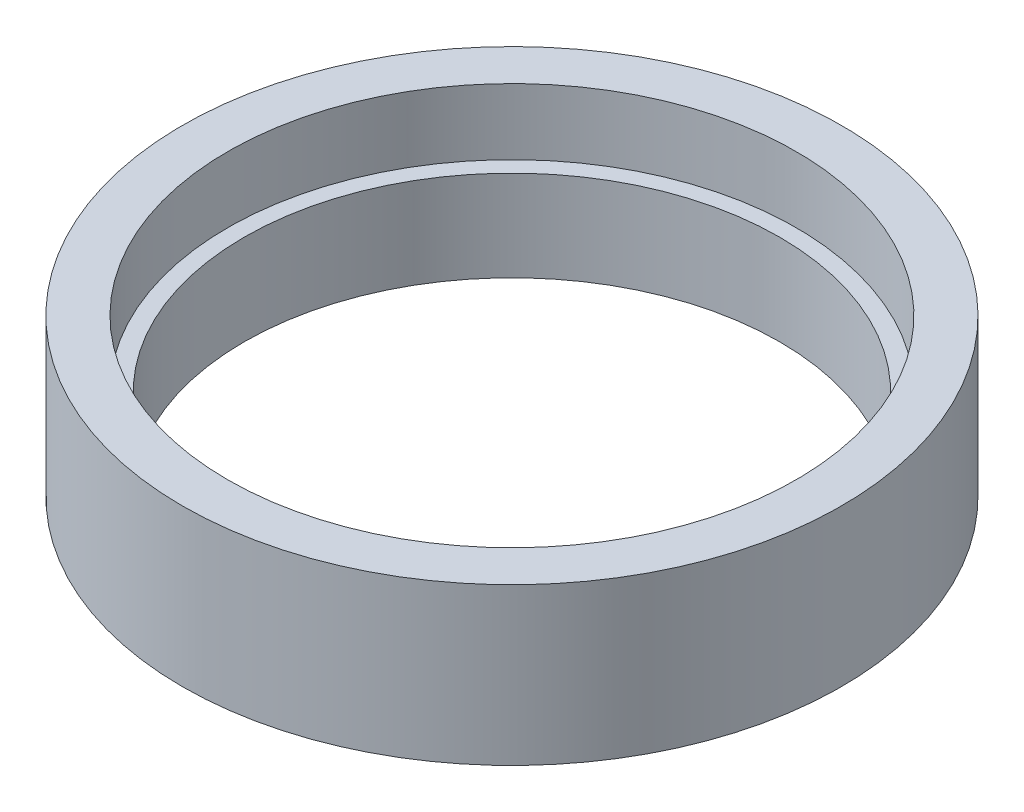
ISO-10303-21;
HEADER;
FILE_DESCRIPTION(('STEP AP214'),'2;1');
FILE_NAME('part.step','',(''),(''),'','','');
FILE_SCHEMA(('AUTOMOTIVE_DESIGN { 1 0 10303 214 1 1 1 1 }'));
ENDSEC;
DATA;
#1=APPLICATION_CONTEXT('core data for automotive mechanical design processes');
#2=APPLICATION_PROTOCOL_DEFINITION('international standard','automotive_design',2000,#1);
#3=PRODUCT_CONTEXT('',#1,'mechanical');
#4=PRODUCT('Part','Part','',(#3));
#5=PRODUCT_RELATED_PRODUCT_CATEGORY('part','',(#4));
#6=PRODUCT_DEFINITION_FORMATION('','',#4);
#7=PRODUCT_DEFINITION_CONTEXT('part definition',#1,'design');
#8=PRODUCT_DEFINITION('design','',#6,#7);
#9=PRODUCT_DEFINITION_SHAPE('','',#8);
#10=(LENGTH_UNIT() NAMED_UNIT(*) SI_UNIT(.MILLI.,.METRE.));
#11=(NAMED_UNIT(*) PLANE_ANGLE_UNIT() SI_UNIT($,.RADIAN.));
#12=(NAMED_UNIT(*) SI_UNIT($,.STERADIAN.) SOLID_ANGLE_UNIT());
#13=UNCERTAINTY_MEASURE_WITH_UNIT(LENGTH_MEASURE(1.E-05),#10,'distance_accuracy_value','');
#14=(GEOMETRIC_REPRESENTATION_CONTEXT(3) GLOBAL_UNCERTAINTY_ASSIGNED_CONTEXT((#13)) GLOBAL_UNIT_ASSIGNED_CONTEXT((#10,
#11,#12)) REPRESENTATION_CONTEXT('',''));
#15=CARTESIAN_POINT('',(0.,0.,0.));
#16=DIRECTION('',(0.,0.,1.));
#17=DIRECTION('',(1.,0.,0.));
#18=AXIS2_PLACEMENT_3D('',#15,#16,#17);
#19=CARTESIAN_POINT('',(0.,19.,0.));
#20=DIRECTION('',(0.,-1.,0.));
#21=DIRECTION('',(0.,0.,-1.));
#22=AXIS2_PLACEMENT_3D('',#19,#20,#21);
#23=CYLINDRICAL_SURFACE('',#22,40.);
#24=CARTESIAN_POINT('',(0.,19.,0.));
#25=DIRECTION('',(0.,1.,0.));
#26=DIRECTION('',(0.,0.,1.));
#27=AXIS2_PLACEMENT_3D('',#24,#25,#26);
#28=CIRCLE('',#27,40.);
#29=CARTESIAN_POINT('',(0.,19.,40.));
#30=VERTEX_POINT('',#29);
#31=EDGE_CURVE('E10',#30,#30,#28,.T.);
#32=ORIENTED_EDGE('',*,*,#31,.F.);
#33=EDGE_LOOP('',(#32));
#34=FACE_BOUND('',#33,.T.);
#35=CARTESIAN_POINT('',(0.,0.,0.));
#36=DIRECTION('',(0.,1.,0.));
#37=DIRECTION('',(0.,0.,1.));
#38=AXIS2_PLACEMENT_3D('',#35,#36,#37);
#39=CIRCLE('',#38,40.);
#40=CARTESIAN_POINT('',(0.,0.,40.));
#41=VERTEX_POINT('',#40);
#42=EDGE_CURVE('E34',#41,#41,#39,.T.);
#43=ORIENTED_EDGE('',*,*,#42,.T.);
#44=EDGE_LOOP('',(#43));
#45=FACE_BOUND('',#44,.T.);
#46=ADVANCED_FACE('F31',(#34,#45),#23,.T.);
#47=CARTESIAN_POINT('',(0.,19.,0.));
#48=DIRECTION('',(0.,1.,0.));
#49=DIRECTION('',(0.,0.,1.));
#50=AXIS2_PLACEMENT_3D('',#47,#48,#49);
#51=PLANE('',#50);
#52=CARTESIAN_POINT('',(0.,19.,0.));
#53=DIRECTION('',(0.,1.,0.));
#54=DIRECTION('',(0.,0.,1.));
#55=AXIS2_PLACEMENT_3D('',#52,#53,#54);
#56=CIRCLE('',#55,34.5);
#57=CARTESIAN_POINT('',(0.,19.,34.5));
#58=VERTEX_POINT('',#57);
#59=EDGE_CURVE('E43',#58,#58,#56,.T.);
#60=ORIENTED_EDGE('',*,*,#59,.F.);
#61=EDGE_LOOP('',(#60));
#62=FACE_BOUND('',#61,.T.);
#63=ORIENTED_EDGE('',*,*,#31,.T.);
#64=EDGE_LOOP('',(#63));
#65=FACE_BOUND('',#64,.T.);
#66=ADVANCED_FACE('F71',(#62,#65),#51,.T.);
#67=CARTESIAN_POINT('',(0.,0.,0.));
#68=DIRECTION('',(0.,1.,0.));
#69=DIRECTION('',(0.,0.,1.));
#70=AXIS2_PLACEMENT_3D('',#67,#68,#69);
#71=PLANE('',#70);
#72=CARTESIAN_POINT('',(0.,0.,0.));
#73=DIRECTION('',(0.,1.,0.));
#74=DIRECTION('',(0.,0.,1.));
#75=AXIS2_PLACEMENT_3D('',#72,#73,#74);
#76=CIRCLE('',#75,32.5);
#77=CARTESIAN_POINT('',(0.,0.,32.5));
#78=VERTEX_POINT('',#77);
#79=EDGE_CURVE('E46',#78,#78,#76,.T.);
#80=ORIENTED_EDGE('',*,*,#79,.T.);
#81=EDGE_LOOP('',(#80));
#82=FACE_BOUND('',#81,.T.);
#83=ORIENTED_EDGE('',*,*,#42,.F.);
#84=EDGE_LOOP('',(#83));
#85=FACE_BOUND('',#84,.T.);
#86=ADVANCED_FACE('F67',(#82,#85),#71,.F.);
#87=CARTESIAN_POINT('',(0.,11.,0.));
#88=DIRECTION('',(0.,1.,0.));
#89=DIRECTION('',(0.,0.,1.));
#90=AXIS2_PLACEMENT_3D('',#87,#88,#89);
#91=CYLINDRICAL_SURFACE('',#90,34.5);
#92=CARTESIAN_POINT('',(0.,11.,0.));
#93=DIRECTION('',(0.,1.,0.));
#94=DIRECTION('',(0.,0.,1.));
#95=AXIS2_PLACEMENT_3D('',#92,#93,#94);
#96=CIRCLE('',#95,34.5);
#97=CARTESIAN_POINT('',(0.,11.,34.5));
#98=VERTEX_POINT('',#97);
#99=EDGE_CURVE('E41',#98,#98,#96,.T.);
#100=ORIENTED_EDGE('',*,*,#99,.F.);
#101=EDGE_LOOP('',(#100));
#102=FACE_BOUND('',#101,.T.);
#103=ORIENTED_EDGE('',*,*,#59,.T.);
#104=EDGE_LOOP('',(#103));
#105=FACE_BOUND('',#104,.T.);
#106=ADVANCED_FACE('F61',(#102,#105),#91,.F.);
#107=CARTESIAN_POINT('',(0.,11.,0.));
#108=DIRECTION('',(0.,1.,0.));
#109=DIRECTION('',(0.,0.,1.));
#110=AXIS2_PLACEMENT_3D('',#107,#108,#109);
#111=PLANE('',#110);
#112=CARTESIAN_POINT('',(0.,11.,0.));
#113=DIRECTION('',(0.,1.,0.));
#114=DIRECTION('',(0.,0.,1.));
#115=AXIS2_PLACEMENT_3D('',#112,#113,#114);
#116=CIRCLE('',#115,32.5);
#117=CARTESIAN_POINT('',(0.,11.,32.5));
#118=VERTEX_POINT('',#117);
#119=EDGE_CURVE('E51',#118,#118,#116,.T.);
#120=ORIENTED_EDGE('',*,*,#119,.F.);
#121=EDGE_LOOP('',(#120));
#122=FACE_BOUND('',#121,.T.);
#123=ORIENTED_EDGE('',*,*,#99,.T.);
#124=EDGE_LOOP('',(#123));
#125=FACE_BOUND('',#124,.T.);
#126=ADVANCED_FACE('F58',(#122,#125),#111,.T.);
#127=CARTESIAN_POINT('',(0.,-37.,0.));
#128=DIRECTION('',(0.,1.,0.));
#129=DIRECTION('',(0.,0.,1.));
#130=AXIS2_PLACEMENT_3D('',#127,#128,#129);
#131=CYLINDRICAL_SURFACE('',#130,32.5);
#132=CARTESIAN_POINT('',(0.,11.,32.5));
#133=CARTESIAN_POINT('',(0.,10.8854166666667,32.5));
#134=CARTESIAN_POINT('',(0.,10.7708333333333,32.5));
#135=CARTESIAN_POINT('',(0.,10.5416666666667,32.5));
#136=CARTESIAN_POINT('',(0.,10.4270833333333,32.5));
#137=CARTESIAN_POINT('',(0.,10.1979166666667,32.5));
#138=CARTESIAN_POINT('',(0.,10.0833333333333,32.5));
#139=CARTESIAN_POINT('',(0.,9.85416666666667,32.5));
#140=CARTESIAN_POINT('',(0.,9.73958333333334,32.5));
#141=CARTESIAN_POINT('',(0.,9.51041666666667,32.5));
#142=CARTESIAN_POINT('',(0.,9.39583333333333,32.5));
#143=CARTESIAN_POINT('',(0.,9.16666666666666,32.5));
#144=CARTESIAN_POINT('',(0.,9.05208333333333,32.5));
#145=CARTESIAN_POINT('',(0.,8.82291666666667,32.5));
#146=CARTESIAN_POINT('',(0.,8.70833333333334,32.5));
#147=CARTESIAN_POINT('',(0.,8.47916666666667,32.5));
#148=CARTESIAN_POINT('',(0.,8.36458333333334,32.5));
#149=CARTESIAN_POINT('',(0.,8.13541666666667,32.5));
#150=CARTESIAN_POINT('',(0.,8.02083333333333,32.5));
#151=CARTESIAN_POINT('',(0.,7.79166666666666,32.5));
#152=CARTESIAN_POINT('',(0.,7.67708333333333,32.5));
#153=CARTESIAN_POINT('',(0.,7.44791666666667,32.5));
#154=CARTESIAN_POINT('',(0.,7.33333333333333,32.5));
#155=CARTESIAN_POINT('',(0.,7.10416666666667,32.5));
#156=CARTESIAN_POINT('',(0.,6.98958333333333,32.5));
#157=CARTESIAN_POINT('',(0.,6.76041666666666,32.5));
#158=CARTESIAN_POINT('',(0.,6.64583333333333,32.5));
#159=CARTESIAN_POINT('',(0.,6.41666666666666,32.5));
#160=CARTESIAN_POINT('',(0.,6.30208333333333,32.5));
#161=CARTESIAN_POINT('',(0.,6.07291666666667,32.5));
#162=CARTESIAN_POINT('',(0.,5.95833333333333,32.5));
#163=CARTESIAN_POINT('',(0.,5.72916666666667,32.5));
#164=CARTESIAN_POINT('',(0.,5.61458333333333,32.5));
#165=CARTESIAN_POINT('',(0.,5.38541666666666,32.5));
#166=CARTESIAN_POINT('',(0.,5.27083333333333,32.5));
#167=CARTESIAN_POINT('',(0.,5.04166666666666,32.5));
#168=CARTESIAN_POINT('',(0.,4.92708333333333,32.5));
#169=CARTESIAN_POINT('',(0.,4.69791666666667,32.5));
#170=CARTESIAN_POINT('',(0.,4.58333333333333,32.5));
#171=CARTESIAN_POINT('',(0.,4.35416666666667,32.5));
#172=CARTESIAN_POINT('',(0.,4.23958333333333,32.5));
#173=CARTESIAN_POINT('',(0.,4.01041666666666,32.5));
#174=CARTESIAN_POINT('',(0.,3.89583333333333,32.5));
#175=CARTESIAN_POINT('',(0.,3.66666666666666,32.5));
#176=CARTESIAN_POINT('',(0.,3.55208333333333,32.5));
#177=CARTESIAN_POINT('',(0.,3.32291666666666,32.5));
#178=CARTESIAN_POINT('',(0.,3.20833333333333,32.5));
#179=CARTESIAN_POINT('',(0.,2.97916666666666,32.5));
#180=CARTESIAN_POINT('',(0.,2.86458333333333,32.5));
#181=CARTESIAN_POINT('',(0.,2.63541666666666,32.5));
#182=CARTESIAN_POINT('',(0.,2.52083333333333,32.5));
#183=CARTESIAN_POINT('',(0.,2.29166666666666,32.5));
#184=CARTESIAN_POINT('',(0.,2.17708333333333,32.5));
#185=CARTESIAN_POINT('',(0.,1.94791666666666,32.5));
#186=CARTESIAN_POINT('',(0.,1.83333333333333,32.5));
#187=CARTESIAN_POINT('',(0.,1.60416666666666,32.5));
#188=CARTESIAN_POINT('',(0.,1.48958333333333,32.5));
#189=CARTESIAN_POINT('',(0.,1.26041666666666,32.5));
#190=CARTESIAN_POINT('',(0.,1.14583333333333,32.5));
#191=CARTESIAN_POINT('',(0.,0.916666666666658,32.5));
#192=CARTESIAN_POINT('',(0.,0.802083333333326,32.5));
#193=CARTESIAN_POINT('',(0.,0.572916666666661,32.5));
#194=CARTESIAN_POINT('',(0.,0.458333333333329,32.5));
#195=CARTESIAN_POINT('',(0.,0.229166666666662,32.5));
#196=CARTESIAN_POINT('',(0.,0.114583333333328,32.5));
#197=CARTESIAN_POINT('',(0.,0.,32.5));
#198=B_SPLINE_CURVE_WITH_KNOTS('',3,(#132,#133,#134,#135,#136,#137,#138,#139,#140,#141,#142,
#143,#144,#145,#146,#147,#148,#149,#150,#151,#152,#153,#154,#155,#156,#157,#158,#159,#160,#161,
#162,#163,#164,#165,#166,#167,#168,#169,#170,#171,#172,#173,#174,#175,#176,#177,#178,#179,#180,
#181,#182,#183,#184,#185,#186,#187,#188,#189,#190,#191,#192,#193,#194,#195,#196,#197),
.UNSPECIFIED.,.F.,.F.,(4,2,2,2,2,2,2,2,2,2,2,2,2,2,2,2,2,2,2,2,2,2,2,2,2,2,2,2,2,2,2,2,4),(0.,
0.343750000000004,0.687500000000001,1.03125,1.375,1.71875,2.0625,2.40625,2.75,3.09375000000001,
3.4375,3.78125,4.125,4.46875000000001,4.8125,5.15625,5.50000000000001,5.84375000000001,
6.18750000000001,6.53125,6.87500000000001,7.21875000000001,7.56250000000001,7.90625,
8.25000000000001,8.59375000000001,8.93750000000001,9.28125000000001,9.62500000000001,
9.96875000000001,10.3125,10.65625,11.),.UNSPECIFIED.);
#199=EDGE_CURVE('BSEAM55',#118,#78,#198,.T.);
#200=ORIENTED_EDGE('',*,*,#119,.T.);
#201=ORIENTED_EDGE('',*,*,#79,.F.);
#202=ORIENTED_EDGE('',*,*,#199,.T.);
#203=ORIENTED_EDGE('',*,*,#199,.F.);
#204=EDGE_LOOP('',(#200,#202,#201,#203));
#205=FACE_BOUND('',#204,.T.);
#206=ADVANCED_FACE('F55',(#205),#131,.F.);
#207=CLOSED_SHELL('',(#46,#66,#86,#106,#126,#206));
#208=MANIFOLD_SOLID_BREP('B2',#207);
#209=ADVANCED_BREP_SHAPE_REPRESENTATION('',(#18,#208),#14);
#210=SHAPE_DEFINITION_REPRESENTATION(#9,#209);
ENDSEC;
END-ISO-10303-21;
